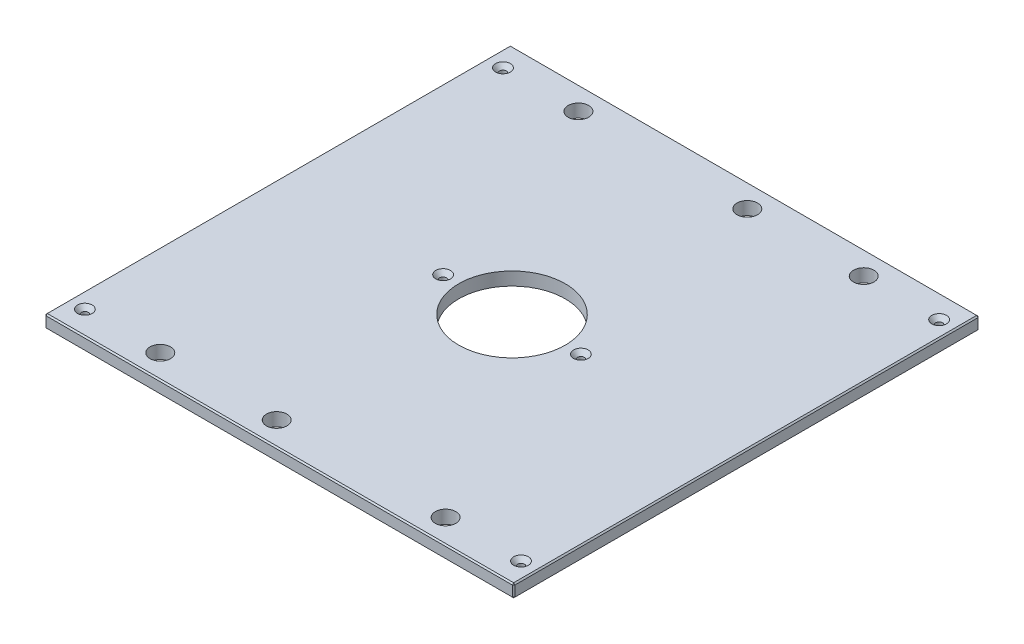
ISO-10303-21;
HEADER;
FILE_DESCRIPTION(('STEP AP214'),'2;1');
FILE_NAME('part.step','',(''),(''),'','','');
FILE_SCHEMA(('AUTOMOTIVE_DESIGN { 1 0 10303 214 1 1 1 1 }'));
ENDSEC;
DATA;
#1=APPLICATION_CONTEXT('core data for automotive mechanical design processes');
#2=APPLICATION_PROTOCOL_DEFINITION('international standard','automotive_design',2000,#1);
#3=PRODUCT_CONTEXT('',#1,'mechanical');
#4=PRODUCT('Part','Part','',(#3));
#5=PRODUCT_RELATED_PRODUCT_CATEGORY('part','',(#4));
#6=PRODUCT_DEFINITION_FORMATION('','',#4);
#7=PRODUCT_DEFINITION_CONTEXT('part definition',#1,'design');
#8=PRODUCT_DEFINITION('design','',#6,#7);
#9=PRODUCT_DEFINITION_SHAPE('','',#8);
#10=(LENGTH_UNIT() NAMED_UNIT(*) SI_UNIT(.MILLI.,.METRE.));
#11=(NAMED_UNIT(*) PLANE_ANGLE_UNIT() SI_UNIT($,.RADIAN.));
#12=(NAMED_UNIT(*) SI_UNIT($,.STERADIAN.) SOLID_ANGLE_UNIT());
#13=UNCERTAINTY_MEASURE_WITH_UNIT(LENGTH_MEASURE(1.E-05),#10,'distance_accuracy_value','');
#14=(GEOMETRIC_REPRESENTATION_CONTEXT(3) GLOBAL_UNCERTAINTY_ASSIGNED_CONTEXT((#13)) GLOBAL_UNIT_ASSIGNED_CONTEXT((#10,
#11,#12)) REPRESENTATION_CONTEXT('',''));
#15=CARTESIAN_POINT('',(0.,0.,0.));
#16=DIRECTION('',(0.,0.,1.));
#17=DIRECTION('',(1.,0.,0.));
#18=AXIS2_PLACEMENT_3D('',#15,#16,#17);
#19=CARTESIAN_POINT('',(-227.0125,12.7,-225.425));
#20=DIRECTION('',(1.,0.,0.));
#21=DIRECTION('',(0.,0.,-1.));
#22=AXIS2_PLACEMENT_3D('',#19,#20,#21);
#23=PLANE('',#22);
#24=DIRECTION('',(0.,0.,-1.));
#25=VECTOR('',#24,1.);
#26=CARTESIAN_POINT('',(-227.0125,11.43,-225.425));
#27=LINE('',#26,#25);
#28=CARTESIAN_POINT('',(-227.0125,11.43,224.155));
#29=VERTEX_POINT('',#28);
#30=CARTESIAN_POINT('',(-227.0125,11.43,-224.155));
#31=VERTEX_POINT('',#30);
#32=EDGE_CURVE('E135',#29,#31,#27,.T.);
#33=ORIENTED_EDGE('',*,*,#32,.T.);
#34=DIRECTION('',(0.,-1.,0.));
#35=VECTOR('',#34,1.);
#36=CARTESIAN_POINT('',(-227.0125,12.7,-224.155));
#37=LINE('',#36,#35);
#38=CARTESIAN_POINT('',(-227.0125,1.26999999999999,-224.155));
#39=VERTEX_POINT('',#38);
#40=EDGE_CURVE('E131',#31,#39,#37,.T.);
#41=ORIENTED_EDGE('',*,*,#40,.T.);
#42=DIRECTION('',(0.,0.,1.));
#43=VECTOR('',#42,1.);
#44=CARTESIAN_POINT('',(-227.0125,1.26999999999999,-225.425));
#45=LINE('',#44,#43);
#46=CARTESIAN_POINT('',(-227.0125,1.26999999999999,224.155));
#47=VERTEX_POINT('',#46);
#48=EDGE_CURVE('E126',#39,#47,#45,.T.);
#49=ORIENTED_EDGE('',*,*,#48,.T.);
#50=DIRECTION('',(0.,1.,0.));
#51=VECTOR('',#50,1.);
#52=CARTESIAN_POINT('',(-227.0125,12.7,224.155));
#53=LINE('',#52,#51);
#54=EDGE_CURVE('E128',#47,#29,#53,.T.);
#55=ORIENTED_EDGE('',*,*,#54,.T.);
#56=EDGE_LOOP('',(#33,#41,#49,#55));
#57=FACE_BOUND('',#56,.T.);
#58=ADVANCED_FACE('F35',(#57),#23,.F.);
#59=CARTESIAN_POINT('',(-227.0125,12.7,225.425));
#60=DIRECTION('',(0.,0.,-1.));
#61=DIRECTION('',(-1.,0.,0.));
#62=AXIS2_PLACEMENT_3D('',#59,#60,#61);
#63=PLANE('',#62);
#64=DIRECTION('',(1.,0.,0.));
#65=VECTOR('',#64,1.);
#66=CARTESIAN_POINT('',(-227.0125,1.26999999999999,225.425));
#67=LINE('',#66,#65);
#68=CARTESIAN_POINT('',(-225.7425,1.26999999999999,225.425));
#69=VERTEX_POINT('',#68);
#70=CARTESIAN_POINT('',(225.7425,1.26999999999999,225.425));
#71=VERTEX_POINT('',#70);
#72=EDGE_CURVE('E58',#69,#71,#67,.T.);
#73=ORIENTED_EDGE('',*,*,#72,.T.);
#74=DIRECTION('',(0.,1.,0.));
#75=VECTOR('',#74,1.);
#76=CARTESIAN_POINT('',(225.7425,12.7,225.425));
#77=LINE('',#76,#75);
#78=CARTESIAN_POINT('',(225.7425,11.43,225.425));
#79=VERTEX_POINT('',#78);
#80=EDGE_CURVE('E11',#71,#79,#77,.T.);
#81=ORIENTED_EDGE('',*,*,#80,.T.);
#82=DIRECTION('',(-1.,0.,0.));
#83=VECTOR('',#82,1.);
#84=CARTESIAN_POINT('',(-227.0125,11.43,225.425));
#85=LINE('',#84,#83);
#86=CARTESIAN_POINT('',(-225.7425,11.43,225.425));
#87=VERTEX_POINT('',#86);
#88=EDGE_CURVE('E44',#79,#87,#85,.T.);
#89=ORIENTED_EDGE('',*,*,#88,.T.);
#90=DIRECTION('',(0.,-1.,0.));
#91=VECTOR('',#90,1.);
#92=CARTESIAN_POINT('',(-225.7425,12.7,225.425));
#93=LINE('',#92,#91);
#94=EDGE_CURVE('E291',#87,#69,#93,.T.);
#95=ORIENTED_EDGE('',*,*,#94,.T.);
#96=EDGE_LOOP('',(#73,#81,#89,#95));
#97=FACE_BOUND('',#96,.T.);
#98=ADVANCED_FACE('F360',(#97),#63,.F.);
#99=CARTESIAN_POINT('',(227.0125,12.7,-225.425));
#100=DIRECTION('',(-1.,0.,0.));
#101=DIRECTION('',(0.,0.,1.));
#102=AXIS2_PLACEMENT_3D('',#99,#100,#101);
#103=PLANE('',#102);
#104=DIRECTION('',(0.,0.,-1.));
#105=VECTOR('',#104,1.);
#106=CARTESIAN_POINT('',(227.0125,1.26999999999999,-225.425));
#107=LINE('',#106,#105);
#108=CARTESIAN_POINT('',(227.0125,1.26999999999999,224.155));
#109=VERTEX_POINT('',#108);
#110=CARTESIAN_POINT('',(227.0125,1.26999999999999,-224.155));
#111=VERTEX_POINT('',#110);
#112=EDGE_CURVE('E286',#109,#111,#107,.T.);
#113=ORIENTED_EDGE('',*,*,#112,.T.);
#114=DIRECTION('',(0.,1.,0.));
#115=VECTOR('',#114,1.);
#116=CARTESIAN_POINT('',(227.0125,12.7,-224.155));
#117=LINE('',#116,#115);
#118=CARTESIAN_POINT('',(227.0125,11.43,-224.155));
#119=VERTEX_POINT('',#118);
#120=EDGE_CURVE('E288',#111,#119,#117,.T.);
#121=ORIENTED_EDGE('',*,*,#120,.T.);
#122=DIRECTION('',(0.,0.,1.));
#123=VECTOR('',#122,1.);
#124=CARTESIAN_POINT('',(227.0125,11.43,225.425));
#125=LINE('',#124,#123);
#126=CARTESIAN_POINT('',(227.0125,11.43,224.155));
#127=VERTEX_POINT('',#126);
#128=EDGE_CURVE('E284',#119,#127,#125,.T.);
#129=ORIENTED_EDGE('',*,*,#128,.T.);
#130=DIRECTION('',(0.,-1.,0.));
#131=VECTOR('',#130,1.);
#132=CARTESIAN_POINT('',(227.0125,12.7,224.155));
#133=LINE('',#132,#131);
#134=EDGE_CURVE('E282',#127,#109,#133,.T.);
#135=ORIENTED_EDGE('',*,*,#134,.T.);
#136=EDGE_LOOP('',(#113,#121,#129,#135));
#137=FACE_BOUND('',#136,.T.);
#138=ADVANCED_FACE('F347',(#137),#103,.F.);
#139=CARTESIAN_POINT('',(-227.0125,12.7,-225.425));
#140=DIRECTION('',(0.,0.,1.));
#141=DIRECTION('',(1.,0.,0.));
#142=AXIS2_PLACEMENT_3D('',#139,#140,#141);
#143=PLANE('',#142);
#144=DIRECTION('',(-1.,0.,0.));
#145=VECTOR('',#144,1.);
#146=CARTESIAN_POINT('',(-227.0125,1.26999999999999,-225.425));
#147=LINE('',#146,#145);
#148=CARTESIAN_POINT('',(225.7425,1.26999999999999,-225.425));
#149=VERTEX_POINT('',#148);
#150=CARTESIAN_POINT('',(-225.7425,1.26999999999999,-225.425));
#151=VERTEX_POINT('',#150);
#152=EDGE_CURVE('E258',#149,#151,#147,.T.);
#153=ORIENTED_EDGE('',*,*,#152,.T.);
#154=DIRECTION('',(0.,1.,0.));
#155=VECTOR('',#154,1.);
#156=CARTESIAN_POINT('',(-225.7425,12.7,-225.425));
#157=LINE('',#156,#155);
#158=CARTESIAN_POINT('',(-225.7425,11.43,-225.425));
#159=VERTEX_POINT('',#158);
#160=EDGE_CURVE('E262',#151,#159,#157,.T.);
#161=ORIENTED_EDGE('',*,*,#160,.T.);
#162=DIRECTION('',(1.,0.,0.));
#163=VECTOR('',#162,1.);
#164=CARTESIAN_POINT('',(227.0125,11.43,-225.425));
#165=LINE('',#164,#163);
#166=CARTESIAN_POINT('',(225.7425,11.43,-225.425));
#167=VERTEX_POINT('',#166);
#168=EDGE_CURVE('E260',#159,#167,#165,.T.);
#169=ORIENTED_EDGE('',*,*,#168,.T.);
#170=DIRECTION('',(0.,-1.,0.));
#171=VECTOR('',#170,1.);
#172=CARTESIAN_POINT('',(225.7425,12.7,-225.425));
#173=LINE('',#172,#171);
#174=EDGE_CURVE('E256',#167,#149,#173,.T.);
#175=ORIENTED_EDGE('',*,*,#174,.T.);
#176=EDGE_LOOP('',(#153,#161,#169,#175));
#177=FACE_BOUND('',#176,.T.);
#178=ADVANCED_FACE('F321',(#177),#143,.F.);
#179=CARTESIAN_POINT('',(0.,12.7,0.));
#180=DIRECTION('',(0.,1.,0.));
#181=DIRECTION('',(0.,0.,1.));
#182=AXIS2_PLACEMENT_3D('',#179,#180,#181);
#183=PLANE('',#182);
#184=CARTESIAN_POINT('',(211.1375,12.7,-202.40498));
#185=DIRECTION('',(0.,1.,0.));
#186=DIRECTION('',(0.,0.,1.));
#187=AXIS2_PLACEMENT_3D('',#184,#185,#186);
#188=CIRCLE('',#187,7.13739999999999);
#189=CARTESIAN_POINT('',(211.1375,12.7,-195.26758));
#190=VERTEX_POINT('',#189);
#191=EDGE_CURVE('E784',#190,#190,#188,.T.);
#192=ORIENTED_EDGE('',*,*,#191,.F.);
#193=EDGE_LOOP('',(#192));
#194=FACE_BOUND('',#193,.T.);
#195=CARTESIAN_POINT('',(211.1375,12.7,202.40498));
#196=DIRECTION('',(0.,1.,0.));
#197=DIRECTION('',(0.,0.,1.));
#198=AXIS2_PLACEMENT_3D('',#195,#196,#197);
#199=CIRCLE('',#198,7.13739999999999);
#200=CARTESIAN_POINT('',(211.1375,12.7,209.54238));
#201=VERTEX_POINT('',#200);
#202=EDGE_CURVE('E788',#201,#201,#199,.T.);
#203=ORIENTED_EDGE('',*,*,#202,.F.);
#204=EDGE_LOOP('',(#203));
#205=FACE_BOUND('',#204,.T.);
#206=CARTESIAN_POINT('',(-211.1375,12.7,202.40498));
#207=DIRECTION('',(0.,1.,0.));
#208=DIRECTION('',(0.,0.,1.));
#209=AXIS2_PLACEMENT_3D('',#206,#207,#208);
#210=CIRCLE('',#209,7.13739999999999);
#211=CARTESIAN_POINT('',(-211.1375,12.7,209.54238));
#212=VERTEX_POINT('',#211);
#213=EDGE_CURVE('E792',#212,#212,#210,.T.);
#214=ORIENTED_EDGE('',*,*,#213,.F.);
#215=EDGE_LOOP('',(#214));
#216=FACE_BOUND('',#215,.T.);
#217=CARTESIAN_POINT('',(-66.675,12.7,0.));
#218=DIRECTION('',(0.,1.,0.));
#219=DIRECTION('',(0.,0.,1.));
#220=AXIS2_PLACEMENT_3D('',#217,#218,#219);
#221=CIRCLE('',#220,7.1374);
#222=CARTESIAN_POINT('',(-66.675,12.7,7.1374));
#223=VERTEX_POINT('',#222);
#224=EDGE_CURVE('E796',#223,#223,#221,.T.);
#225=ORIENTED_EDGE('',*,*,#224,.F.);
#226=EDGE_LOOP('',(#225));
#227=FACE_BOUND('',#226,.T.);
#228=CARTESIAN_POINT('',(66.675,12.7,0.));
#229=DIRECTION('',(0.,1.,0.));
#230=DIRECTION('',(0.,0.,1.));
#231=AXIS2_PLACEMENT_3D('',#228,#229,#230);
#232=CIRCLE('',#231,7.1374);
#233=CARTESIAN_POINT('',(66.675,12.7,7.1374));
#234=VERTEX_POINT('',#233);
#235=EDGE_CURVE('E800',#234,#234,#232,.T.);
#236=ORIENTED_EDGE('',*,*,#235,.F.);
#237=EDGE_LOOP('',(#236));
#238=FACE_BOUND('',#237,.T.);
#239=CARTESIAN_POINT('',(-211.1375,12.7,-202.40498));
#240=DIRECTION('',(0.,1.,0.));
#241=DIRECTION('',(0.,0.,1.));
#242=AXIS2_PLACEMENT_3D('',#239,#240,#241);
#243=CIRCLE('',#242,7.13739999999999);
#244=CARTESIAN_POINT('',(-211.1375,12.7,-195.26758));
#245=VERTEX_POINT('',#244);
#246=EDGE_CURVE('E803',#245,#245,#243,.T.);
#247=ORIENTED_EDGE('',*,*,#246,.F.);
#248=EDGE_LOOP('',(#247));
#249=FACE_BOUND('',#248,.T.);
#250=DIRECTION('',(0.,0.,-1.));
#251=VECTOR('',#250,1.);
#252=CARTESIAN_POINT('',(225.7425,12.7,-225.425));
#253=LINE('',#252,#251);
#254=CARTESIAN_POINT('',(225.7425,12.7,224.155));
#255=VERTEX_POINT('',#254);
#256=CARTESIAN_POINT('',(225.7425,12.7,-224.155));
#257=VERTEX_POINT('',#256);
#258=EDGE_CURVE('E269',#255,#257,#253,.T.);
#259=ORIENTED_EDGE('',*,*,#258,.T.);
#260=DIRECTION('',(-1.,0.,0.));
#261=VECTOR('',#260,1.);
#262=CARTESIAN_POINT('',(-227.0125,12.7,-224.155));
#263=LINE('',#262,#261);
#264=CARTESIAN_POINT('',(-225.7425,12.7,-224.155));
#265=VERTEX_POINT('',#264);
#266=EDGE_CURVE('E271',#257,#265,#263,.T.);
#267=ORIENTED_EDGE('',*,*,#266,.T.);
#268=DIRECTION('',(0.,0.,1.));
#269=VECTOR('',#268,1.);
#270=CARTESIAN_POINT('',(-225.7425,12.7,225.425));
#271=LINE('',#270,#269);
#272=CARTESIAN_POINT('',(-225.7425,12.7,224.155));
#273=VERTEX_POINT('',#272);
#274=EDGE_CURVE('E267',#265,#273,#271,.T.);
#275=ORIENTED_EDGE('',*,*,#274,.T.);
#276=DIRECTION('',(1.,0.,0.));
#277=VECTOR('',#276,1.);
#278=CARTESIAN_POINT('',(227.0125,12.7,224.155));
#279=LINE('',#278,#277);
#280=EDGE_CURVE('E265',#273,#255,#279,.T.);
#281=ORIENTED_EDGE('',*,*,#280,.T.);
#282=EDGE_LOOP('',(#259,#267,#275,#281));
#283=FACE_BOUND('',#282,.T.);
#284=CARTESIAN_POINT('',(138.1125,12.7,-202.40498));
#285=DIRECTION('',(0.,1.,0.));
#286=DIRECTION('',(0.,0.,1.));
#287=AXIS2_PLACEMENT_3D('',#284,#285,#286);
#288=CIRCLE('',#287,9.921875);
#289=CARTESIAN_POINT('',(138.1125,12.7,-192.483105));
#290=VERTEX_POINT('',#289);
#291=EDGE_CURVE('E204',#290,#290,#288,.T.);
#292=ORIENTED_EDGE('',*,*,#291,.F.);
#293=EDGE_LOOP('',(#292));
#294=FACE_BOUND('',#293,.T.);
#295=CARTESIAN_POINT('',(-138.1125,12.7,-202.40498));
#296=DIRECTION('',(0.,1.,0.));
#297=DIRECTION('',(0.,0.,1.));
#298=AXIS2_PLACEMENT_3D('',#295,#296,#297);
#299=CIRCLE('',#298,9.921875);
#300=CARTESIAN_POINT('',(-138.1125,12.7,-192.483105));
#301=VERTEX_POINT('',#300);
#302=EDGE_CURVE('E214',#301,#301,#299,.T.);
#303=ORIENTED_EDGE('',*,*,#302,.F.);
#304=EDGE_LOOP('',(#303));
#305=FACE_BOUND('',#304,.T.);
#306=CARTESIAN_POINT('',(138.1125,12.7,202.40498));
#307=DIRECTION('',(0.,1.,0.));
#308=DIRECTION('',(0.,0.,1.));
#309=AXIS2_PLACEMENT_3D('',#306,#307,#308);
#310=CIRCLE('',#309,9.921875);
#311=CARTESIAN_POINT('',(138.1125,12.7,212.326855));
#312=VERTEX_POINT('',#311);
#313=EDGE_CURVE('E225',#312,#312,#310,.T.);
#314=ORIENTED_EDGE('',*,*,#313,.F.);
#315=EDGE_LOOP('',(#314));
#316=FACE_BOUND('',#315,.T.);
#317=CARTESIAN_POINT('',(-138.1125,12.7,202.40498));
#318=DIRECTION('',(0.,1.,0.));
#319=DIRECTION('',(0.,0.,1.));
#320=AXIS2_PLACEMENT_3D('',#317,#318,#319);
#321=CIRCLE('',#320,9.921875);
#322=CARTESIAN_POINT('',(-138.1125,12.7,212.326855));
#323=VERTEX_POINT('',#322);
#324=EDGE_CURVE('E231',#323,#323,#321,.T.);
#325=ORIENTED_EDGE('',*,*,#324,.F.);
#326=EDGE_LOOP('',(#325));
#327=FACE_BOUND('',#326,.T.);
#328=CARTESIAN_POINT('',(25.4,12.7,-202.40498));
#329=DIRECTION('',(0.,1.,0.));
#330=DIRECTION('',(0.,0.,1.));
#331=AXIS2_PLACEMENT_3D('',#328,#329,#330);
#332=CIRCLE('',#331,9.921875);
#333=CARTESIAN_POINT('',(25.4,12.7,-192.483105));
#334=VERTEX_POINT('',#333);
#335=EDGE_CURVE('E237',#334,#334,#332,.T.);
#336=ORIENTED_EDGE('',*,*,#335,.F.);
#337=EDGE_LOOP('',(#336));
#338=FACE_BOUND('',#337,.T.);
#339=CARTESIAN_POINT('',(-25.4,12.7,202.40498));
#340=DIRECTION('',(0.,1.,0.));
#341=DIRECTION('',(0.,0.,1.));
#342=AXIS2_PLACEMENT_3D('',#339,#340,#341);
#343=CIRCLE('',#342,9.921875);
#344=CARTESIAN_POINT('',(-25.4,12.7,212.326855));
#345=VERTEX_POINT('',#344);
#346=EDGE_CURVE('E243',#345,#345,#343,.T.);
#347=ORIENTED_EDGE('',*,*,#346,.F.);
#348=EDGE_LOOP('',(#347));
#349=FACE_BOUND('',#348,.T.);
#350=CARTESIAN_POINT('',(0.,12.7,0.));
#351=DIRECTION('',(0.,1.,0.));
#352=DIRECTION('',(0.,0.,1.));
#353=AXIS2_PLACEMENT_3D('',#350,#351,#352);
#354=CIRCLE('',#353,51.562);
#355=CARTESIAN_POINT('',(0.,12.7,51.562));
#356=VERTEX_POINT('',#355);
#357=EDGE_CURVE('E249',#356,#356,#354,.T.);
#358=ORIENTED_EDGE('',*,*,#357,.F.);
#359=EDGE_LOOP('',(#358));
#360=FACE_BOUND('',#359,.T.);
#361=ADVANCED_FACE('F369',(#194,#205,#216,#227,#238,#249,#283,#294,#305,#316,#327,#338,#349,
#360),#183,.T.);
#362=CARTESIAN_POINT('',(0.,0.,0.));
#363=DIRECTION('',(0.,1.,0.));
#364=DIRECTION('',(0.,0.,1.));
#365=AXIS2_PLACEMENT_3D('',#362,#363,#364);
#366=PLANE('',#365);
#367=CARTESIAN_POINT('',(211.1375,0.,-202.40498));
#368=DIRECTION('',(0.,1.,0.));
#369=DIRECTION('',(0.,0.,1.));
#370=AXIS2_PLACEMENT_3D('',#367,#368,#369);
#371=CIRCLE('',#370,3.3782);
#372=CARTESIAN_POINT('',(211.1375,0.,-199.02678));
#373=VERTEX_POINT('',#372);
#374=EDGE_CURVE('E837',#373,#373,#371,.T.);
#375=ORIENTED_EDGE('',*,*,#374,.T.);
#376=EDGE_LOOP('',(#375));
#377=FACE_BOUND('',#376,.T.);
#378=CARTESIAN_POINT('',(211.1375,0.,202.40498));
#379=DIRECTION('',(0.,1.,0.));
#380=DIRECTION('',(0.,0.,1.));
#381=AXIS2_PLACEMENT_3D('',#378,#379,#380);
#382=CIRCLE('',#381,3.3782);
#383=CARTESIAN_POINT('',(211.1375,0.,205.78318));
#384=VERTEX_POINT('',#383);
#385=EDGE_CURVE('E830',#384,#384,#382,.T.);
#386=ORIENTED_EDGE('',*,*,#385,.T.);
#387=EDGE_LOOP('',(#386));
#388=FACE_BOUND('',#387,.T.);
#389=CARTESIAN_POINT('',(-211.1375,0.,202.40498));
#390=DIRECTION('',(0.,1.,0.));
#391=DIRECTION('',(0.,0.,1.));
#392=AXIS2_PLACEMENT_3D('',#389,#390,#391);
#393=CIRCLE('',#392,3.3782);
#394=CARTESIAN_POINT('',(-211.1375,0.,205.78318));
#395=VERTEX_POINT('',#394);
#396=EDGE_CURVE('E823',#395,#395,#393,.T.);
#397=ORIENTED_EDGE('',*,*,#396,.T.);
#398=EDGE_LOOP('',(#397));
#399=FACE_BOUND('',#398,.T.);
#400=CARTESIAN_POINT('',(-66.675,0.,0.));
#401=DIRECTION('',(0.,1.,0.));
#402=DIRECTION('',(0.,0.,1.));
#403=AXIS2_PLACEMENT_3D('',#400,#401,#402);
#404=CIRCLE('',#403,3.3782);
#405=CARTESIAN_POINT('',(-66.675,0.,3.3782));
#406=VERTEX_POINT('',#405);
#407=EDGE_CURVE('E816',#406,#406,#404,.T.);
#408=ORIENTED_EDGE('',*,*,#407,.T.);
#409=EDGE_LOOP('',(#408));
#410=FACE_BOUND('',#409,.T.);
#411=CARTESIAN_POINT('',(66.675,0.,0.));
#412=DIRECTION('',(0.,1.,0.));
#413=DIRECTION('',(0.,0.,1.));
#414=AXIS2_PLACEMENT_3D('',#411,#412,#413);
#415=CIRCLE('',#414,3.3782);
#416=CARTESIAN_POINT('',(66.675,0.,3.3782));
#417=VERTEX_POINT('',#416);
#418=EDGE_CURVE('E806',#417,#417,#415,.T.);
#419=ORIENTED_EDGE('',*,*,#418,.T.);
#420=EDGE_LOOP('',(#419));
#421=FACE_BOUND('',#420,.T.);
#422=CARTESIAN_POINT('',(-211.1375,0.,-202.40498));
#423=DIRECTION('',(0.,1.,0.));
#424=DIRECTION('',(0.,0.,1.));
#425=AXIS2_PLACEMENT_3D('',#422,#423,#424);
#426=CIRCLE('',#425,3.3782);
#427=CARTESIAN_POINT('',(-211.1375,0.,-199.02678));
#428=VERTEX_POINT('',#427);
#429=EDGE_CURVE('E217',#428,#428,#426,.T.);
#430=ORIENTED_EDGE('',*,*,#429,.T.);
#431=EDGE_LOOP('',(#430));
#432=FACE_BOUND('',#431,.T.);
#433=DIRECTION('',(0.,0.,-1.));
#434=VECTOR('',#433,1.);
#435=CARTESIAN_POINT('',(-225.7425,0.,0.));
#436=LINE('',#435,#434);
#437=CARTESIAN_POINT('',(-225.7425,0.,224.155));
#438=VERTEX_POINT('',#437);
#439=CARTESIAN_POINT('',(-225.7425,0.,-224.155));
#440=VERTEX_POINT('',#439);
#441=EDGE_CURVE('E158',#438,#440,#436,.T.);
#442=ORIENTED_EDGE('',*,*,#441,.T.);
#443=DIRECTION('',(1.,0.,0.));
#444=VECTOR('',#443,1.);
#445=CARTESIAN_POINT('',(0.,0.,-224.155));
#446=LINE('',#445,#444);
#447=CARTESIAN_POINT('',(225.7425,0.,-224.155));
#448=VERTEX_POINT('',#447);
#449=EDGE_CURVE('E279',#440,#448,#446,.T.);
#450=ORIENTED_EDGE('',*,*,#449,.T.);
#451=DIRECTION('',(0.,0.,1.));
#452=VECTOR('',#451,1.);
#453=CARTESIAN_POINT('',(225.7425,0.,0.));
#454=LINE('',#453,#452);
#455=CARTESIAN_POINT('',(225.7425,0.,224.155));
#456=VERTEX_POINT('',#455);
#457=EDGE_CURVE('E277',#448,#456,#454,.T.);
#458=ORIENTED_EDGE('',*,*,#457,.T.);
#459=DIRECTION('',(-1.,0.,0.));
#460=VECTOR('',#459,1.);
#461=CARTESIAN_POINT('',(0.,0.,224.155));
#462=LINE('',#461,#460);
#463=EDGE_CURVE('E274',#456,#438,#462,.T.);
#464=ORIENTED_EDGE('',*,*,#463,.T.);
#465=EDGE_LOOP('',(#442,#450,#458,#464));
#466=FACE_BOUND('',#465,.T.);
#467=CARTESIAN_POINT('',(138.1125,0.,-202.40498));
#468=DIRECTION('',(0.,1.,0.));
#469=DIRECTION('',(0.,0.,1.));
#470=AXIS2_PLACEMENT_3D('',#467,#468,#469);
#471=CIRCLE('',#470,9.921875);
#472=CARTESIAN_POINT('',(138.1125,0.,-192.483105));
#473=VERTEX_POINT('',#472);
#474=EDGE_CURVE('E209',#473,#473,#471,.T.);
#475=ORIENTED_EDGE('',*,*,#474,.T.);
#476=EDGE_LOOP('',(#475));
#477=FACE_BOUND('',#476,.T.);
#478=CARTESIAN_POINT('',(-138.1125,0.,-202.40498));
#479=DIRECTION('',(0.,1.,0.));
#480=DIRECTION('',(0.,0.,1.));
#481=AXIS2_PLACEMENT_3D('',#478,#479,#480);
#482=CIRCLE('',#481,9.921875);
#483=CARTESIAN_POINT('',(-138.1125,0.,-192.483105));
#484=VERTEX_POINT('',#483);
#485=EDGE_CURVE('E222',#484,#484,#482,.T.);
#486=ORIENTED_EDGE('',*,*,#485,.T.);
#487=EDGE_LOOP('',(#486));
#488=FACE_BOUND('',#487,.T.);
#489=CARTESIAN_POINT('',(138.1125,0.,202.40498));
#490=DIRECTION('',(0.,1.,0.));
#491=DIRECTION('',(0.,0.,1.));
#492=AXIS2_PLACEMENT_3D('',#489,#490,#491);
#493=CIRCLE('',#492,9.921875);
#494=CARTESIAN_POINT('',(138.1125,0.,212.326855));
#495=VERTEX_POINT('',#494);
#496=EDGE_CURVE('E228',#495,#495,#493,.T.);
#497=ORIENTED_EDGE('',*,*,#496,.T.);
#498=EDGE_LOOP('',(#497));
#499=FACE_BOUND('',#498,.T.);
#500=CARTESIAN_POINT('',(-138.1125,0.,202.40498));
#501=DIRECTION('',(0.,1.,0.));
#502=DIRECTION('',(0.,0.,1.));
#503=AXIS2_PLACEMENT_3D('',#500,#501,#502);
#504=CIRCLE('',#503,9.921875);
#505=CARTESIAN_POINT('',(-138.1125,0.,212.326855));
#506=VERTEX_POINT('',#505);
#507=EDGE_CURVE('E234',#506,#506,#504,.T.);
#508=ORIENTED_EDGE('',*,*,#507,.T.);
#509=EDGE_LOOP('',(#508));
#510=FACE_BOUND('',#509,.T.);
#511=CARTESIAN_POINT('',(25.4,0.,-202.40498));
#512=DIRECTION('',(0.,1.,0.));
#513=DIRECTION('',(0.,0.,1.));
#514=AXIS2_PLACEMENT_3D('',#511,#512,#513);
#515=CIRCLE('',#514,9.921875);
#516=CARTESIAN_POINT('',(25.4,0.,-192.483105));
#517=VERTEX_POINT('',#516);
#518=EDGE_CURVE('E240',#517,#517,#515,.T.);
#519=ORIENTED_EDGE('',*,*,#518,.T.);
#520=EDGE_LOOP('',(#519));
#521=FACE_BOUND('',#520,.T.);
#522=CARTESIAN_POINT('',(-25.4,0.,202.40498));
#523=DIRECTION('',(0.,1.,0.));
#524=DIRECTION('',(0.,0.,1.));
#525=AXIS2_PLACEMENT_3D('',#522,#523,#524);
#526=CIRCLE('',#525,9.921875);
#527=CARTESIAN_POINT('',(-25.4,0.,212.326855));
#528=VERTEX_POINT('',#527);
#529=EDGE_CURVE('E246',#528,#528,#526,.T.);
#530=ORIENTED_EDGE('',*,*,#529,.T.);
#531=EDGE_LOOP('',(#530));
#532=FACE_BOUND('',#531,.T.);
#533=CARTESIAN_POINT('',(0.,0.,0.));
#534=DIRECTION('',(0.,1.,0.));
#535=DIRECTION('',(0.,0.,1.));
#536=AXIS2_PLACEMENT_3D('',#533,#534,#535);
#537=CIRCLE('',#536,51.562);
#538=CARTESIAN_POINT('',(0.,0.,51.562));
#539=VERTEX_POINT('',#538);
#540=EDGE_CURVE('E147',#539,#539,#537,.T.);
#541=ORIENTED_EDGE('',*,*,#540,.T.);
#542=EDGE_LOOP('',(#541));
#543=FACE_BOUND('',#542,.T.);
#544=ADVANCED_FACE('F334',(#377,#388,#399,#410,#421,#432,#466,#477,#488,#499,#510,#521,#532,
#543),#366,.F.);
#545=CARTESIAN_POINT('',(0.,0.,0.));
#546=DIRECTION('',(0.,1.,0.));
#547=DIRECTION('',(0.,0.,1.));
#548=AXIS2_PLACEMENT_3D('',#545,#546,#547);
#549=CYLINDRICAL_SURFACE('',#548,51.562);
#550=ORIENTED_EDGE('',*,*,#540,.F.);
#551=EDGE_LOOP('',(#550));
#552=FACE_BOUND('',#551,.T.);
#553=ORIENTED_EDGE('',*,*,#357,.T.);
#554=EDGE_LOOP('',(#553));
#555=FACE_BOUND('',#554,.T.);
#556=ADVANCED_FACE('F721',(#552,#555),#549,.F.);
#557=CARTESIAN_POINT('',(-25.4,12.7,202.40498));
#558=DIRECTION('',(0.,1.,0.));
#559=DIRECTION('',(0.,0.,1.));
#560=AXIS2_PLACEMENT_3D('',#557,#558,#559);
#561=CYLINDRICAL_SURFACE('',#560,9.921875);
#562=ORIENTED_EDGE('',*,*,#529,.F.);
#563=EDGE_LOOP('',(#562));
#564=FACE_BOUND('',#563,.T.);
#565=ORIENTED_EDGE('',*,*,#346,.T.);
#566=EDGE_LOOP('',(#565));
#567=FACE_BOUND('',#566,.T.);
#568=ADVANCED_FACE('F712',(#564,#567),#561,.F.);
#569=CARTESIAN_POINT('',(25.4,12.7,-202.40498));
#570=DIRECTION('',(0.,1.,0.));
#571=DIRECTION('',(0.,0.,1.));
#572=AXIS2_PLACEMENT_3D('',#569,#570,#571);
#573=CYLINDRICAL_SURFACE('',#572,9.921875);
#574=ORIENTED_EDGE('',*,*,#518,.F.);
#575=EDGE_LOOP('',(#574));
#576=FACE_BOUND('',#575,.T.);
#577=ORIENTED_EDGE('',*,*,#335,.T.);
#578=EDGE_LOOP('',(#577));
#579=FACE_BOUND('',#578,.T.);
#580=ADVANCED_FACE('F703',(#576,#579),#573,.F.);
#581=CARTESIAN_POINT('',(-138.1125,12.7,202.40498));
#582=DIRECTION('',(0.,1.,0.));
#583=DIRECTION('',(0.,0.,1.));
#584=AXIS2_PLACEMENT_3D('',#581,#582,#583);
#585=CYLINDRICAL_SURFACE('',#584,9.921875);
#586=ORIENTED_EDGE('',*,*,#507,.F.);
#587=EDGE_LOOP('',(#586));
#588=FACE_BOUND('',#587,.T.);
#589=ORIENTED_EDGE('',*,*,#324,.T.);
#590=EDGE_LOOP('',(#589));
#591=FACE_BOUND('',#590,.T.);
#592=ADVANCED_FACE('F694',(#588,#591),#585,.F.);
#593=CARTESIAN_POINT('',(138.1125,12.7,202.40498));
#594=DIRECTION('',(0.,1.,0.));
#595=DIRECTION('',(0.,0.,1.));
#596=AXIS2_PLACEMENT_3D('',#593,#594,#595);
#597=CYLINDRICAL_SURFACE('',#596,9.921875);
#598=ORIENTED_EDGE('',*,*,#496,.F.);
#599=EDGE_LOOP('',(#598));
#600=FACE_BOUND('',#599,.T.);
#601=ORIENTED_EDGE('',*,*,#313,.T.);
#602=EDGE_LOOP('',(#601));
#603=FACE_BOUND('',#602,.T.);
#604=ADVANCED_FACE('F685',(#600,#603),#597,.F.);
#605=CARTESIAN_POINT('',(-138.1125,12.7,-202.40498));
#606=DIRECTION('',(0.,1.,0.));
#607=DIRECTION('',(0.,0.,1.));
#608=AXIS2_PLACEMENT_3D('',#605,#606,#607);
#609=CYLINDRICAL_SURFACE('',#608,9.921875);
#610=ORIENTED_EDGE('',*,*,#485,.F.);
#611=EDGE_LOOP('',(#610));
#612=FACE_BOUND('',#611,.T.);
#613=ORIENTED_EDGE('',*,*,#302,.T.);
#614=EDGE_LOOP('',(#613));
#615=FACE_BOUND('',#614,.T.);
#616=ADVANCED_FACE('F675',(#612,#615),#609,.F.);
#617=CARTESIAN_POINT('',(138.1125,12.7,-202.40498));
#618=DIRECTION('',(0.,1.,0.));
#619=DIRECTION('',(0.,0.,1.));
#620=AXIS2_PLACEMENT_3D('',#617,#618,#619);
#621=CYLINDRICAL_SURFACE('',#620,9.921875);
#622=ORIENTED_EDGE('',*,*,#474,.F.);
#623=EDGE_LOOP('',(#622));
#624=FACE_BOUND('',#623,.T.);
#625=ORIENTED_EDGE('',*,*,#291,.T.);
#626=EDGE_LOOP('',(#625));
#627=FACE_BOUND('',#626,.T.);
#628=ADVANCED_FACE('F378',(#624,#627),#621,.F.);
#629=CARTESIAN_POINT('',(227.0125,12.7,224.155));
#630=DIRECTION('',(-0.707106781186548,0.,-0.707106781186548));
#631=DIRECTION('',(0.,-1.,0.));
#632=AXIS2_PLACEMENT_3D('',#629,#630,#631);
#633=PLANE('',#632);
#634=DIRECTION('',(-0.707106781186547,0.,0.707106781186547));
#635=VECTOR('',#634,1.);
#636=CARTESIAN_POINT('',(227.0125,11.43,224.155));
#637=LINE('',#636,#635);
#638=EDGE_CURVE('E39',#79,#127,#637,.F.);
#639=ORIENTED_EDGE('',*,*,#638,.F.);
#640=ORIENTED_EDGE('',*,*,#80,.F.);
#641=DIRECTION('',(0.707106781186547,0.,-0.707106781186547));
#642=VECTOR('',#641,1.);
#643=CARTESIAN_POINT('',(226.3775,1.26999999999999,224.79));
#644=LINE('',#643,#642);
#645=EDGE_CURVE('E197',#109,#71,#644,.F.);
#646=ORIENTED_EDGE('',*,*,#645,.F.);
#647=ORIENTED_EDGE('',*,*,#134,.F.);
#648=EDGE_LOOP('',(#639,#640,#646,#647));
#649=FACE_BOUND('',#648,.T.);
#650=ADVANCED_FACE('F37',(#649),#633,.F.);
#651=CARTESIAN_POINT('',(227.0125,11.43,224.155));
#652=DIRECTION('',(0.577350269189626,0.577350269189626,0.577350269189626));
#653=DIRECTION('',(0.707106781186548,0.,-0.707106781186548));
#654=AXIS2_PLACEMENT_3D('',#651,#652,#653);
#655=PLANE('',#654);
#656=DIRECTION('',(0.,-0.707106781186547,0.707106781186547));
#657=VECTOR('',#656,1.);
#658=CARTESIAN_POINT('',(225.7425,12.065,224.79));
#659=LINE('',#658,#657);
#660=EDGE_CURVE('E193',#79,#255,#659,.F.);
#661=ORIENTED_EDGE('',*,*,#660,.F.);
#662=ORIENTED_EDGE('',*,*,#638,.T.);
#663=DIRECTION('',(-0.707106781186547,0.707106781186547,0.));
#664=VECTOR('',#663,1.);
#665=CARTESIAN_POINT('',(227.0125,11.43,224.155));
#666=LINE('',#665,#664);
#667=EDGE_CURVE('E195',#255,#127,#666,.F.);
#668=ORIENTED_EDGE('',*,*,#667,.F.);
#669=EDGE_LOOP('',(#661,#662,#668));
#670=FACE_BOUND('',#669,.T.);
#671=ADVANCED_FACE('F371',(#670),#655,.T.);
#672=CARTESIAN_POINT('',(225.7425,0.,224.155));
#673=DIRECTION('',(0.577350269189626,-0.577350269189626,0.577350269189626));
#674=DIRECTION('',(0.707106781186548,0.,-0.707106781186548));
#675=AXIS2_PLACEMENT_3D('',#672,#673,#674);
#676=PLANE('',#675);
#677=DIRECTION('',(-0.707106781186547,-0.707106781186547,0.));
#678=VECTOR('',#677,1.);
#679=CARTESIAN_POINT('',(225.7425,0.,224.155));
#680=LINE('',#679,#678);
#681=EDGE_CURVE('E187',#109,#456,#680,.T.);
#682=ORIENTED_EDGE('',*,*,#681,.F.);
#683=ORIENTED_EDGE('',*,*,#645,.T.);
#684=DIRECTION('',(0.,0.707106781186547,0.707106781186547));
#685=VECTOR('',#684,1.);
#686=CARTESIAN_POINT('',(225.7425,0.,224.155));
#687=LINE('',#686,#685);
#688=EDGE_CURVE('E190',#456,#71,#687,.T.);
#689=ORIENTED_EDGE('',*,*,#688,.F.);
#690=EDGE_LOOP('',(#682,#683,#689));
#691=FACE_BOUND('',#690,.T.);
#692=ADVANCED_FACE('F340',(#691),#676,.T.);
#693=CARTESIAN_POINT('',(225.7425,12.7,0.));
#694=DIRECTION('',(0.707106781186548,0.707106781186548,0.));
#695=DIRECTION('',(0.,0.,1.));
#696=AXIS2_PLACEMENT_3D('',#693,#694,#695);
#697=PLANE('',#696);
#698=ORIENTED_EDGE('',*,*,#667,.T.);
#699=ORIENTED_EDGE('',*,*,#128,.F.);
#700=DIRECTION('',(0.707106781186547,-0.707106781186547,0.));
#701=VECTOR('',#700,1.);
#702=CARTESIAN_POINT('',(226.3775,12.065,-224.155));
#703=LINE('',#702,#701);
#704=EDGE_CURVE('E182',#257,#119,#703,.T.);
#705=ORIENTED_EDGE('',*,*,#704,.F.);
#706=ORIENTED_EDGE('',*,*,#258,.F.);
#707=EDGE_LOOP('',(#698,#699,#705,#706));
#708=FACE_BOUND('',#707,.T.);
#709=ADVANCED_FACE('F357',(#708),#697,.T.);
#710=CARTESIAN_POINT('',(0.,12.7,224.155));
#711=DIRECTION('',(0.,0.707106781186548,0.707106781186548));
#712=DIRECTION('',(-1.,0.,0.));
#713=AXIS2_PLACEMENT_3D('',#710,#711,#712);
#714=PLANE('',#713);
#715=ORIENTED_EDGE('',*,*,#660,.T.);
#716=ORIENTED_EDGE('',*,*,#280,.F.);
#717=DIRECTION('',(0.,0.707106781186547,-0.707106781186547));
#718=VECTOR('',#717,1.);
#719=CARTESIAN_POINT('',(-225.7425,12.7,224.155));
#720=LINE('',#719,#718);
#721=EDGE_CURVE('E179',#87,#273,#720,.T.);
#722=ORIENTED_EDGE('',*,*,#721,.F.);
#723=ORIENTED_EDGE('',*,*,#88,.F.);
#724=EDGE_LOOP('',(#715,#716,#722,#723));
#725=FACE_BOUND('',#724,.T.);
#726=ADVANCED_FACE('F362',(#725),#714,.T.);
#727=CARTESIAN_POINT('',(-225.7425,12.7,225.425));
#728=DIRECTION('',(0.707106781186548,0.,-0.707106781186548));
#729=DIRECTION('',(0.,-1.,0.));
#730=AXIS2_PLACEMENT_3D('',#727,#728,#729);
#731=PLANE('',#730);
#732=DIRECTION('',(0.707106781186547,0.,0.707106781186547));
#733=VECTOR('',#732,1.);
#734=CARTESIAN_POINT('',(-227.0125,1.26999999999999,224.155));
#735=LINE('',#734,#733);
#736=EDGE_CURVE('E142',#69,#47,#735,.F.);
#737=ORIENTED_EDGE('',*,*,#736,.F.);
#738=ORIENTED_EDGE('',*,*,#94,.F.);
#739=DIRECTION('',(-0.707106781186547,0.,-0.707106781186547));
#740=VECTOR('',#739,1.);
#741=CARTESIAN_POINT('',(-226.3775,11.43,224.79));
#742=LINE('',#741,#740);
#743=EDGE_CURVE('E145',#29,#87,#742,.F.);
#744=ORIENTED_EDGE('',*,*,#743,.F.);
#745=ORIENTED_EDGE('',*,*,#54,.F.);
#746=EDGE_LOOP('',(#737,#738,#744,#745));
#747=FACE_BOUND('',#746,.T.);
#748=ADVANCED_FACE('F140',(#747),#731,.F.);
#749=CARTESIAN_POINT('',(-227.0125,1.26999999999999,225.425));
#750=DIRECTION('',(0.,0.707106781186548,-0.707106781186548));
#751=DIRECTION('',(1.,0.,0.));
#752=AXIS2_PLACEMENT_3D('',#749,#750,#751);
#753=PLANE('',#752);
#754=ORIENTED_EDGE('',*,*,#688,.T.);
#755=ORIENTED_EDGE('',*,*,#72,.F.);
#756=DIRECTION('',(0.,-0.707106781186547,-0.707106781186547));
#757=VECTOR('',#756,1.);
#758=CARTESIAN_POINT('',(-225.7425,0.634999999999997,224.79));
#759=LINE('',#758,#757);
#760=EDGE_CURVE('E155',#438,#69,#759,.F.);
#761=ORIENTED_EDGE('',*,*,#760,.F.);
#762=ORIENTED_EDGE('',*,*,#463,.F.);
#763=EDGE_LOOP('',(#754,#755,#761,#762));
#764=FACE_BOUND('',#763,.T.);
#765=ADVANCED_FACE('F339',(#764),#753,.F.);
#766=CARTESIAN_POINT('',(227.0125,1.26999999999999,-225.425));
#767=DIRECTION('',(-0.707106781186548,0.707106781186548,0.));
#768=DIRECTION('',(0.,0.,-1.));
#769=AXIS2_PLACEMENT_3D('',#766,#767,#768);
#770=PLANE('',#769);
#771=ORIENTED_EDGE('',*,*,#681,.T.);
#772=ORIENTED_EDGE('',*,*,#457,.F.);
#773=DIRECTION('',(0.707106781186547,0.707106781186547,0.));
#774=VECTOR('',#773,1.);
#775=CARTESIAN_POINT('',(225.7425,0.,-224.155));
#776=LINE('',#775,#774);
#777=EDGE_CURVE('E174',#111,#448,#776,.F.);
#778=ORIENTED_EDGE('',*,*,#777,.F.);
#779=ORIENTED_EDGE('',*,*,#112,.F.);
#780=EDGE_LOOP('',(#771,#772,#778,#779));
#781=FACE_BOUND('',#780,.T.);
#782=ADVANCED_FACE('F344',(#781),#770,.F.);
#783=CARTESIAN_POINT('',(225.7425,12.7,-225.425));
#784=DIRECTION('',(-0.707106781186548,0.,0.707106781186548));
#785=DIRECTION('',(0.,-1.,0.));
#786=AXIS2_PLACEMENT_3D('',#783,#784,#785);
#787=PLANE('',#786);
#788=DIRECTION('',(0.707106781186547,0.,0.707106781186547));
#789=VECTOR('',#788,1.);
#790=CARTESIAN_POINT('',(225.7425,11.43,-225.425));
#791=LINE('',#790,#789);
#792=EDGE_CURVE('E184',#119,#167,#791,.F.);
#793=ORIENTED_EDGE('',*,*,#792,.F.);
#794=ORIENTED_EDGE('',*,*,#120,.F.);
#795=DIRECTION('',(-0.707106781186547,0.,-0.707106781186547));
#796=VECTOR('',#795,1.);
#797=CARTESIAN_POINT('',(226.3775,1.26999999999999,-224.79));
#798=LINE('',#797,#796);
#799=EDGE_CURVE('E171',#149,#111,#798,.F.);
#800=ORIENTED_EDGE('',*,*,#799,.F.);
#801=ORIENTED_EDGE('',*,*,#174,.F.);
#802=EDGE_LOOP('',(#793,#794,#800,#801));
#803=FACE_BOUND('',#802,.T.);
#804=ADVANCED_FACE('F352',(#803),#787,.F.);
#805=CARTESIAN_POINT('',(225.7425,11.43,-225.425));
#806=DIRECTION('',(0.577350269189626,0.577350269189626,-0.577350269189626));
#807=DIRECTION('',(-0.707106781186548,0.,-0.707106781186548));
#808=AXIS2_PLACEMENT_3D('',#805,#806,#807);
#809=PLANE('',#808);
#810=ORIENTED_EDGE('',*,*,#704,.T.);
#811=ORIENTED_EDGE('',*,*,#792,.T.);
#812=DIRECTION('',(0.,0.707106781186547,0.707106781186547));
#813=VECTOR('',#812,1.);
#814=CARTESIAN_POINT('',(225.7425,11.43,-225.425));
#815=LINE('',#814,#813);
#816=EDGE_CURVE('E163',#257,#167,#815,.F.);
#817=ORIENTED_EDGE('',*,*,#816,.F.);
#818=EDGE_LOOP('',(#810,#811,#817));
#819=FACE_BOUND('',#818,.T.);
#820=ADVANCED_FACE('F410',(#819),#809,.T.);
#821=CARTESIAN_POINT('',(-225.7425,12.7,224.155));
#822=DIRECTION('',(-0.577350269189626,0.577350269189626,0.577350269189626));
#823=DIRECTION('',(0.707106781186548,0.,0.707106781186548));
#824=AXIS2_PLACEMENT_3D('',#821,#822,#823);
#825=PLANE('',#824);
#826=ORIENTED_EDGE('',*,*,#743,.T.);
#827=ORIENTED_EDGE('',*,*,#721,.T.);
#828=DIRECTION('',(-0.707106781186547,-0.707106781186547,0.));
#829=VECTOR('',#828,1.);
#830=CARTESIAN_POINT('',(-225.7425,12.7,224.155));
#831=LINE('',#830,#829);
#832=EDGE_CURVE('E159',#29,#273,#831,.F.);
#833=ORIENTED_EDGE('',*,*,#832,.F.);
#834=EDGE_LOOP('',(#826,#827,#833));
#835=FACE_BOUND('',#834,.T.);
#836=ADVANCED_FACE('F364',(#835),#825,.T.);
#837=CARTESIAN_POINT('',(-227.0125,1.26999999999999,224.155));
#838=DIRECTION('',(-0.577350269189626,-0.577350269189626,0.577350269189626));
#839=DIRECTION('',(0.707106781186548,0.,0.707106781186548));
#840=AXIS2_PLACEMENT_3D('',#837,#838,#839);
#841=PLANE('',#840);
#842=ORIENTED_EDGE('',*,*,#760,.T.);
#843=ORIENTED_EDGE('',*,*,#736,.T.);
#844=DIRECTION('',(-0.707106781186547,0.707106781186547,0.));
#845=VECTOR('',#844,1.);
#846=CARTESIAN_POINT('',(-227.0125,1.26999999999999,224.155));
#847=LINE('',#846,#845);
#848=EDGE_CURVE('E152',#438,#47,#847,.T.);
#849=ORIENTED_EDGE('',*,*,#848,.F.);
#850=EDGE_LOOP('',(#842,#843,#849));
#851=FACE_BOUND('',#850,.T.);
#852=ADVANCED_FACE('F151',(#851),#841,.T.);
#853=CARTESIAN_POINT('',(225.7425,0.,-224.155));
#854=DIRECTION('',(0.577350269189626,-0.577350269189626,-0.577350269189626));
#855=DIRECTION('',(-0.707106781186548,0.,-0.707106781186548));
#856=AXIS2_PLACEMENT_3D('',#853,#854,#855);
#857=PLANE('',#856);
#858=ORIENTED_EDGE('',*,*,#799,.T.);
#859=ORIENTED_EDGE('',*,*,#777,.T.);
#860=DIRECTION('',(0.,-0.707106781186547,0.707106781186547));
#861=VECTOR('',#860,1.);
#862=CARTESIAN_POINT('',(225.7425,0.,-224.155));
#863=LINE('',#862,#861);
#864=EDGE_CURVE('E160',#149,#448,#863,.T.);
#865=ORIENTED_EDGE('',*,*,#864,.F.);
#866=EDGE_LOOP('',(#858,#859,#865));
#867=FACE_BOUND('',#866,.T.);
#868=ADVANCED_FACE('F402',(#867),#857,.T.);
#869=CARTESIAN_POINT('',(0.,12.7,-224.155));
#870=DIRECTION('',(0.,0.707106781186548,-0.707106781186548));
#871=DIRECTION('',(1.,0.,0.));
#872=AXIS2_PLACEMENT_3D('',#869,#870,#871);
#873=PLANE('',#872);
#874=ORIENTED_EDGE('',*,*,#816,.T.);
#875=ORIENTED_EDGE('',*,*,#168,.F.);
#876=DIRECTION('',(0.,-0.707106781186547,-0.707106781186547));
#877=VECTOR('',#876,1.);
#878=CARTESIAN_POINT('',(-225.7425,11.43,-225.425));
#879=LINE('',#878,#877);
#880=EDGE_CURVE('E165',#265,#159,#879,.T.);
#881=ORIENTED_EDGE('',*,*,#880,.F.);
#882=ORIENTED_EDGE('',*,*,#266,.F.);
#883=EDGE_LOOP('',(#874,#875,#881,#882));
#884=FACE_BOUND('',#883,.T.);
#885=ADVANCED_FACE('F316',(#884),#873,.T.);
#886=CARTESIAN_POINT('',(-225.7425,12.7,0.));
#887=DIRECTION('',(-0.707106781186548,0.707106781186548,0.));
#888=DIRECTION('',(0.,0.,-1.));
#889=AXIS2_PLACEMENT_3D('',#886,#887,#888);
#890=PLANE('',#889);
#891=ORIENTED_EDGE('',*,*,#832,.T.);
#892=ORIENTED_EDGE('',*,*,#274,.F.);
#893=DIRECTION('',(0.707106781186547,0.707106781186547,0.));
#894=VECTOR('',#893,1.);
#895=CARTESIAN_POINT('',(-226.3775,12.065,-224.155));
#896=LINE('',#895,#894);
#897=EDGE_CURVE('E305',#31,#265,#896,.T.);
#898=ORIENTED_EDGE('',*,*,#897,.F.);
#899=ORIENTED_EDGE('',*,*,#32,.F.);
#900=EDGE_LOOP('',(#891,#892,#898,#899));
#901=FACE_BOUND('',#900,.T.);
#902=ADVANCED_FACE('F367',(#901),#890,.T.);
#903=CARTESIAN_POINT('',(-227.0125,1.26999999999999,-225.425));
#904=DIRECTION('',(0.707106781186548,0.707106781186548,0.));
#905=DIRECTION('',(0.,0.,1.));
#906=AXIS2_PLACEMENT_3D('',#903,#904,#905);
#907=PLANE('',#906);
#908=ORIENTED_EDGE('',*,*,#848,.T.);
#909=ORIENTED_EDGE('',*,*,#48,.F.);
#910=DIRECTION('',(0.707106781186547,-0.707106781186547,0.));
#911=VECTOR('',#910,1.);
#912=CARTESIAN_POINT('',(-227.0125,1.26999999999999,-224.155));
#913=LINE('',#912,#911);
#914=EDGE_CURVE('E302',#440,#39,#913,.F.);
#915=ORIENTED_EDGE('',*,*,#914,.F.);
#916=ORIENTED_EDGE('',*,*,#441,.F.);
#917=EDGE_LOOP('',(#908,#909,#915,#916));
#918=FACE_BOUND('',#917,.T.);
#919=ADVANCED_FACE('F157',(#918),#907,.F.);
#920=CARTESIAN_POINT('',(-227.0125,1.26999999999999,-225.425));
#921=DIRECTION('',(0.,0.707106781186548,0.707106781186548));
#922=DIRECTION('',(-1.,0.,0.));
#923=AXIS2_PLACEMENT_3D('',#920,#921,#922);
#924=PLANE('',#923);
#925=ORIENTED_EDGE('',*,*,#864,.T.);
#926=ORIENTED_EDGE('',*,*,#449,.F.);
#927=DIRECTION('',(0.,0.707106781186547,-0.707106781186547));
#928=VECTOR('',#927,1.);
#929=CARTESIAN_POINT('',(-225.7425,0.634999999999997,-224.79));
#930=LINE('',#929,#928);
#931=EDGE_CURVE('E299',#151,#440,#930,.F.);
#932=ORIENTED_EDGE('',*,*,#931,.F.);
#933=ORIENTED_EDGE('',*,*,#152,.F.);
#934=EDGE_LOOP('',(#925,#926,#932,#933));
#935=FACE_BOUND('',#934,.T.);
#936=ADVANCED_FACE('F331',(#935),#924,.F.);
#937=CARTESIAN_POINT('',(-225.7425,11.43,-225.425));
#938=DIRECTION('',(-0.577350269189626,0.577350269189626,-0.577350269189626));
#939=DIRECTION('',(-0.707106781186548,0.,0.707106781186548));
#940=AXIS2_PLACEMENT_3D('',#937,#938,#939);
#941=PLANE('',#940);
#942=ORIENTED_EDGE('',*,*,#897,.T.);
#943=ORIENTED_EDGE('',*,*,#880,.T.);
#944=DIRECTION('',(0.707106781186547,0.,-0.707106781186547));
#945=VECTOR('',#944,1.);
#946=CARTESIAN_POINT('',(-225.7425,11.43,-225.425));
#947=LINE('',#946,#945);
#948=EDGE_CURVE('E297',#31,#159,#947,.T.);
#949=ORIENTED_EDGE('',*,*,#948,.F.);
#950=EDGE_LOOP('',(#942,#943,#949));
#951=FACE_BOUND('',#950,.T.);
#952=ADVANCED_FACE('F311',(#951),#941,.T.);
#953=CARTESIAN_POINT('',(-227.0125,1.26999999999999,-224.155));
#954=DIRECTION('',(-0.577350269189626,-0.577350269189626,-0.577350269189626));
#955=DIRECTION('',(-0.707106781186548,0.,0.707106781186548));
#956=AXIS2_PLACEMENT_3D('',#953,#954,#955);
#957=PLANE('',#956);
#958=ORIENTED_EDGE('',*,*,#931,.T.);
#959=ORIENTED_EDGE('',*,*,#914,.T.);
#960=DIRECTION('',(-0.707106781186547,0.,0.707106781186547));
#961=VECTOR('',#960,1.);
#962=CARTESIAN_POINT('',(-227.0125,1.26999999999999,-224.155));
#963=LINE('',#962,#961);
#964=EDGE_CURVE('E295',#151,#39,#963,.T.);
#965=ORIENTED_EDGE('',*,*,#964,.F.);
#966=EDGE_LOOP('',(#958,#959,#965));
#967=FACE_BOUND('',#966,.T.);
#968=ADVANCED_FACE('F328',(#967),#957,.T.);
#969=CARTESIAN_POINT('',(-227.0125,12.7,-224.155));
#970=DIRECTION('',(0.707106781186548,0.,0.707106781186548));
#971=DIRECTION('',(0.,-1.,0.));
#972=AXIS2_PLACEMENT_3D('',#969,#970,#971);
#973=PLANE('',#972);
#974=ORIENTED_EDGE('',*,*,#948,.T.);
#975=ORIENTED_EDGE('',*,*,#160,.F.);
#976=ORIENTED_EDGE('',*,*,#964,.T.);
#977=ORIENTED_EDGE('',*,*,#40,.F.);
#978=EDGE_LOOP('',(#974,#975,#976,#977));
#979=FACE_BOUND('',#978,.T.);
#980=ADVANCED_FACE('F326',(#979),#973,.F.);
#981=CARTESIAN_POINT('',(-211.1375,12.7,-202.40498));
#982=DIRECTION('',(0.,1.,0.));
#983=DIRECTION('',(0.,0.,1.));
#984=AXIS2_PLACEMENT_3D('',#981,#982,#983);
#985=CYLINDRICAL_SURFACE('',#984,3.3782);
#986=ORIENTED_EDGE('',*,*,#429,.F.);
#987=EDGE_LOOP('',(#986));
#988=FACE_BOUND('',#987,.T.);
#989=CARTESIAN_POINT('',(-211.1375,8.37553508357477,-202.40498));
#990=DIRECTION('',(0.,1.,0.));
#991=DIRECTION('',(0.,0.,1.));
#992=AXIS2_PLACEMENT_3D('',#989,#990,#991);
#993=CIRCLE('',#992,3.3782);
#994=CARTESIAN_POINT('',(-211.1375,8.37553508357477,-199.02678));
#995=VERTEX_POINT('',#994);
#996=EDGE_CURVE('E805',#995,#995,#993,.T.);
#997=ORIENTED_EDGE('',*,*,#996,.T.);
#998=EDGE_LOOP('',(#997));
#999=FACE_BOUND('',#998,.T.);
#1000=ADVANCED_FACE('F389',(#988,#999),#985,.F.);
#1001=CARTESIAN_POINT('',(-211.1375,12.7,-202.40498));
#1002=DIRECTION('',(0.,1.,0.));
#1003=DIRECTION('',(0.,0.,1.));
#1004=AXIS2_PLACEMENT_3D('',#1001,#1002,#1003);
#1005=CONICAL_SURFACE('',#1004,7.13739999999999,0.715584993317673);
#1006=ORIENTED_EDGE('',*,*,#996,.F.);
#1007=EDGE_LOOP('',(#1006));
#1008=FACE_BOUND('',#1007,.T.);
#1009=ORIENTED_EDGE('',*,*,#246,.T.);
#1010=EDGE_LOOP('',(#1009));
#1011=FACE_BOUND('',#1010,.T.);
#1012=ADVANCED_FACE('F499',(#1008,#1011),#1005,.F.);
#1013=CARTESIAN_POINT('',(66.675,12.7,0.));
#1014=DIRECTION('',(0.,1.,0.));
#1015=DIRECTION('',(0.,0.,1.));
#1016=AXIS2_PLACEMENT_3D('',#1013,#1014,#1015);
#1017=CYLINDRICAL_SURFACE('',#1016,3.3782);
#1018=ORIENTED_EDGE('',*,*,#418,.F.);
#1019=EDGE_LOOP('',(#1018));
#1020=FACE_BOUND('',#1019,.T.);
#1021=CARTESIAN_POINT('',(66.675,8.37553508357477,0.));
#1022=DIRECTION('',(0.,1.,0.));
#1023=DIRECTION('',(0.,0.,1.));
#1024=AXIS2_PLACEMENT_3D('',#1021,#1022,#1023);
#1025=CIRCLE('',#1024,3.3782);
#1026=CARTESIAN_POINT('',(66.675,8.37553508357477,3.3782));
#1027=VERTEX_POINT('',#1026);
#1028=EDGE_CURVE('E810',#1027,#1027,#1025,.T.);
#1029=ORIENTED_EDGE('',*,*,#1028,.T.);
#1030=EDGE_LOOP('',(#1029));
#1031=FACE_BOUND('',#1030,.T.);
#1032=ADVANCED_FACE('F508',(#1020,#1031),#1017,.F.);
#1033=CARTESIAN_POINT('',(66.675,12.7,0.));
#1034=DIRECTION('',(0.,1.,0.));
#1035=DIRECTION('',(0.,0.,1.));
#1036=AXIS2_PLACEMENT_3D('',#1033,#1034,#1035);
#1037=CONICAL_SURFACE('',#1036,7.1374,0.715584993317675);
#1038=ORIENTED_EDGE('',*,*,#1028,.F.);
#1039=EDGE_LOOP('',(#1038));
#1040=FACE_BOUND('',#1039,.T.);
#1041=ORIENTED_EDGE('',*,*,#235,.T.);
#1042=EDGE_LOOP('',(#1041));
#1043=FACE_BOUND('',#1042,.T.);
#1044=ADVANCED_FACE('F516',(#1040,#1043),#1037,.F.);
#1045=CARTESIAN_POINT('',(-66.675,12.7,0.));
#1046=DIRECTION('',(0.,1.,0.));
#1047=DIRECTION('',(0.,0.,1.));
#1048=AXIS2_PLACEMENT_3D('',#1045,#1046,#1047);
#1049=CYLINDRICAL_SURFACE('',#1048,3.3782);
#1050=ORIENTED_EDGE('',*,*,#407,.F.);
#1051=EDGE_LOOP('',(#1050));
#1052=FACE_BOUND('',#1051,.T.);
#1053=CARTESIAN_POINT('',(-66.675,8.37553508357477,0.));
#1054=DIRECTION('',(0.,1.,0.));
#1055=DIRECTION('',(0.,0.,1.));
#1056=AXIS2_PLACEMENT_3D('',#1053,#1054,#1055);
#1057=CIRCLE('',#1056,3.3782);
#1058=CARTESIAN_POINT('',(-66.675,8.37553508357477,3.3782));
#1059=VERTEX_POINT('',#1058);
#1060=EDGE_CURVE('E819',#1059,#1059,#1057,.T.);
#1061=ORIENTED_EDGE('',*,*,#1060,.T.);
#1062=EDGE_LOOP('',(#1061));
#1063=FACE_BOUND('',#1062,.T.);
#1064=ADVANCED_FACE('F524',(#1052,#1063),#1049,.F.);
#1065=CARTESIAN_POINT('',(-66.675,12.7,0.));
#1066=DIRECTION('',(0.,1.,0.));
#1067=DIRECTION('',(0.,0.,1.));
#1068=AXIS2_PLACEMENT_3D('',#1065,#1066,#1067);
#1069=CONICAL_SURFACE('',#1068,7.1374,0.715584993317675);
#1070=ORIENTED_EDGE('',*,*,#1060,.F.);
#1071=EDGE_LOOP('',(#1070));
#1072=FACE_BOUND('',#1071,.T.);
#1073=ORIENTED_EDGE('',*,*,#224,.T.);
#1074=EDGE_LOOP('',(#1073));
#1075=FACE_BOUND('',#1074,.T.);
#1076=ADVANCED_FACE('F532',(#1072,#1075),#1069,.F.);
#1077=CARTESIAN_POINT('',(-211.1375,12.7,202.40498));
#1078=DIRECTION('',(0.,1.,0.));
#1079=DIRECTION('',(0.,0.,1.));
#1080=AXIS2_PLACEMENT_3D('',#1077,#1078,#1079);
#1081=CYLINDRICAL_SURFACE('',#1080,3.3782);
#1082=ORIENTED_EDGE('',*,*,#396,.F.);
#1083=EDGE_LOOP('',(#1082));
#1084=FACE_BOUND('',#1083,.T.);
#1085=CARTESIAN_POINT('',(-211.1375,8.37553508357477,202.40498));
#1086=DIRECTION('',(0.,1.,0.));
#1087=DIRECTION('',(0.,0.,1.));
#1088=AXIS2_PLACEMENT_3D('',#1085,#1086,#1087);
#1089=CIRCLE('',#1088,3.3782);
#1090=CARTESIAN_POINT('',(-211.1375,8.37553508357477,205.78318));
#1091=VERTEX_POINT('',#1090);
#1092=EDGE_CURVE('E826',#1091,#1091,#1089,.T.);
#1093=ORIENTED_EDGE('',*,*,#1092,.T.);
#1094=EDGE_LOOP('',(#1093));
#1095=FACE_BOUND('',#1094,.T.);
#1096=ADVANCED_FACE('F540',(#1084,#1095),#1081,.F.);
#1097=CARTESIAN_POINT('',(-211.1375,12.7,202.40498));
#1098=DIRECTION('',(0.,1.,0.));
#1099=DIRECTION('',(0.,0.,1.));
#1100=AXIS2_PLACEMENT_3D('',#1097,#1098,#1099);
#1101=CONICAL_SURFACE('',#1100,7.13739999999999,0.715584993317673);
#1102=ORIENTED_EDGE('',*,*,#1092,.F.);
#1103=EDGE_LOOP('',(#1102));
#1104=FACE_BOUND('',#1103,.T.);
#1105=ORIENTED_EDGE('',*,*,#213,.T.);
#1106=EDGE_LOOP('',(#1105));
#1107=FACE_BOUND('',#1106,.T.);
#1108=ADVANCED_FACE('F548',(#1104,#1107),#1101,.F.);
#1109=CARTESIAN_POINT('',(211.1375,12.7,202.40498));
#1110=DIRECTION('',(0.,1.,0.));
#1111=DIRECTION('',(0.,0.,1.));
#1112=AXIS2_PLACEMENT_3D('',#1109,#1110,#1111);
#1113=CYLINDRICAL_SURFACE('',#1112,3.3782);
#1114=ORIENTED_EDGE('',*,*,#385,.F.);
#1115=EDGE_LOOP('',(#1114));
#1116=FACE_BOUND('',#1115,.T.);
#1117=CARTESIAN_POINT('',(211.1375,8.37553508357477,202.40498));
#1118=DIRECTION('',(0.,1.,0.));
#1119=DIRECTION('',(0.,0.,1.));
#1120=AXIS2_PLACEMENT_3D('',#1117,#1118,#1119);
#1121=CIRCLE('',#1120,3.3782);
#1122=CARTESIAN_POINT('',(211.1375,8.37553508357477,205.78318));
#1123=VERTEX_POINT('',#1122);
#1124=EDGE_CURVE('E833',#1123,#1123,#1121,.T.);
#1125=ORIENTED_EDGE('',*,*,#1124,.T.);
#1126=EDGE_LOOP('',(#1125));
#1127=FACE_BOUND('',#1126,.T.);
#1128=ADVANCED_FACE('F556',(#1116,#1127),#1113,.F.);
#1129=CARTESIAN_POINT('',(211.1375,12.7,202.40498));
#1130=DIRECTION('',(0.,1.,0.));
#1131=DIRECTION('',(0.,0.,1.));
#1132=AXIS2_PLACEMENT_3D('',#1129,#1130,#1131);
#1133=CONICAL_SURFACE('',#1132,7.13739999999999,0.715584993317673);
#1134=ORIENTED_EDGE('',*,*,#1124,.F.);
#1135=EDGE_LOOP('',(#1134));
#1136=FACE_BOUND('',#1135,.T.);
#1137=ORIENTED_EDGE('',*,*,#202,.T.);
#1138=EDGE_LOOP('',(#1137));
#1139=FACE_BOUND('',#1138,.T.);
#1140=ADVANCED_FACE('F564',(#1136,#1139),#1133,.F.);
#1141=CARTESIAN_POINT('',(211.1375,12.7,-202.40498));
#1142=DIRECTION('',(0.,1.,0.));
#1143=DIRECTION('',(0.,0.,1.));
#1144=AXIS2_PLACEMENT_3D('',#1141,#1142,#1143);
#1145=CYLINDRICAL_SURFACE('',#1144,3.3782);
#1146=ORIENTED_EDGE('',*,*,#374,.F.);
#1147=EDGE_LOOP('',(#1146));
#1148=FACE_BOUND('',#1147,.T.);
#1149=CARTESIAN_POINT('',(211.1375,8.37553508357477,-202.40498));
#1150=DIRECTION('',(0.,1.,0.));
#1151=DIRECTION('',(0.,0.,1.));
#1152=AXIS2_PLACEMENT_3D('',#1149,#1150,#1151);
#1153=CIRCLE('',#1152,3.3782);
#1154=CARTESIAN_POINT('',(211.1375,8.37553508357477,-199.02678));
#1155=VERTEX_POINT('',#1154);
#1156=EDGE_CURVE('E840',#1155,#1155,#1153,.T.);
#1157=ORIENTED_EDGE('',*,*,#1156,.T.);
#1158=EDGE_LOOP('',(#1157));
#1159=FACE_BOUND('',#1158,.T.);
#1160=ADVANCED_FACE('F572',(#1148,#1159),#1145,.F.);
#1161=CARTESIAN_POINT('',(211.1375,12.7,-202.40498));
#1162=DIRECTION('',(0.,1.,0.));
#1163=DIRECTION('',(0.,0.,1.));
#1164=AXIS2_PLACEMENT_3D('',#1161,#1162,#1163);
#1165=CONICAL_SURFACE('',#1164,7.13739999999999,0.715584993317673);
#1166=ORIENTED_EDGE('',*,*,#1156,.F.);
#1167=EDGE_LOOP('',(#1166));
#1168=FACE_BOUND('',#1167,.T.);
#1169=ORIENTED_EDGE('',*,*,#191,.T.);
#1170=EDGE_LOOP('',(#1169));
#1171=FACE_BOUND('',#1170,.T.);
#1172=ADVANCED_FACE('F580',(#1168,#1171),#1165,.F.);
#1173=CLOSED_SHELL('',(#58,#98,#138,#178,#361,#544,#556,#568,#580,#592,#604,#616,#628,#650,#671,
#692,#709,#726,#748,#765,#782,#804,#820,#836,#852,#868,#885,#902,#919,#936,#952,#968,#980,#1000,
#1012,#1032,#1044,#1064,#1076,#1096,#1108,#1128,#1140,#1160,#1172));
#1174=MANIFOLD_SOLID_BREP('B2',#1173);
#1175=ADVANCED_BREP_SHAPE_REPRESENTATION('',(#18,#1174),#14);
#1176=SHAPE_DEFINITION_REPRESENTATION(#9,#1175);
ENDSEC;
END-ISO-10303-21;
